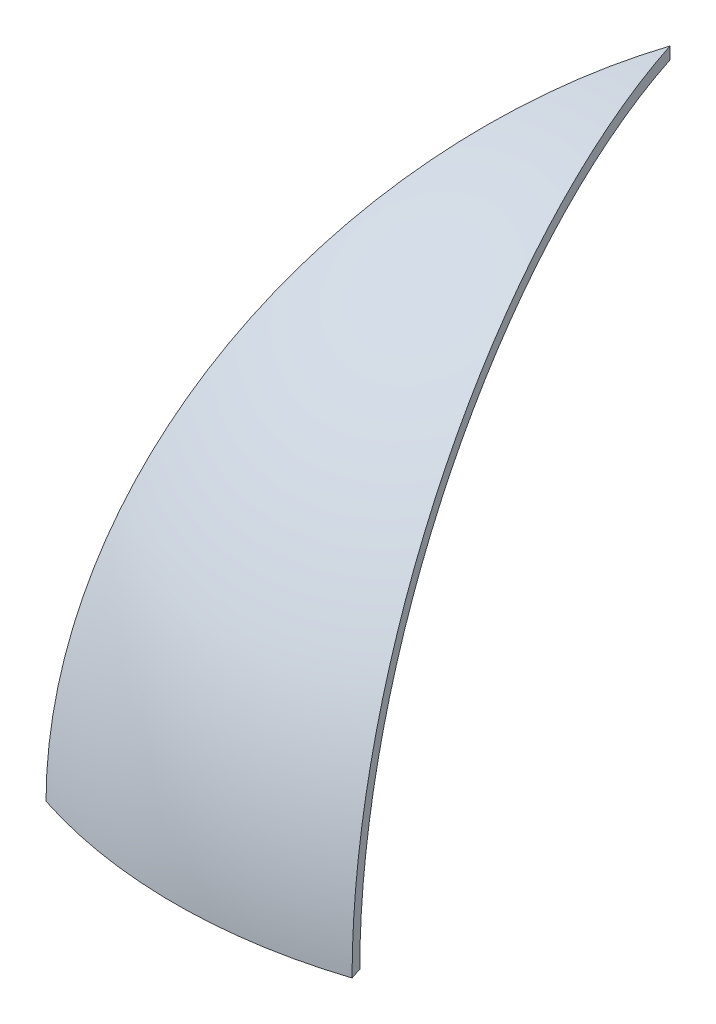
from build123d import *

# Parameters (mm, degrees)
SCHNITT_LINEAR_AUSTRAGEN1_DEPTH = 1500


with BuildPart() as part:
    # Skizze2 → Rotation3 (revolve)
    with BuildSketch(Plane(origin=(0, 0, 0), x_dir=(0, 0, -1), z_dir=(1, 0, 0))):
        with BuildLine():
            Line((0, 0), (0, 1025))
            ThreePointArc((0, 1025), (724.784450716, 724.784450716), (1025, 0))
            Line((1025, 0), (0, 0))
        make_face()
    revolve(axis=Axis((0, 0, 0), (0, 1, 0)))

    # Skizze1 → Schnitt-Rotation1 (revolve, cut)
    with BuildSketch(Plane(origin=(0, 0, 0), x_dir=(0, 0, -1), z_dir=(1, 0, 0))):
        with BuildLine():
            Line((0, 0), (0, 1000))
            ThreePointArc((0, 1000), (707.106781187, 707.106781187), (1000, 0))
            Line((1000, 0), (0, 0))
        make_face()
    revolve(axis=Axis((0, 0, 0), (0, 1, 0)), mode=Mode.SUBTRACT)

    # Skizze4 → Schnitt-Linear austragen1 (cut)
    with BuildSketch(Plane.XZ):
        with BuildLine():
            Line((0, 0), (-324.467844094, 998.60934211))
            ThreePointArc((-324.467844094, 998.60934211), (0, -1050), (324.467844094, 998.60934211))
            Line((324.467844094, 998.60934211), (0, 0))
        make_face()
    extrude(amount=-SCHNITT_LINEAR_AUSTRAGEN1_DEPTH, mode=Mode.SUBTRACT)


solid = part.part
